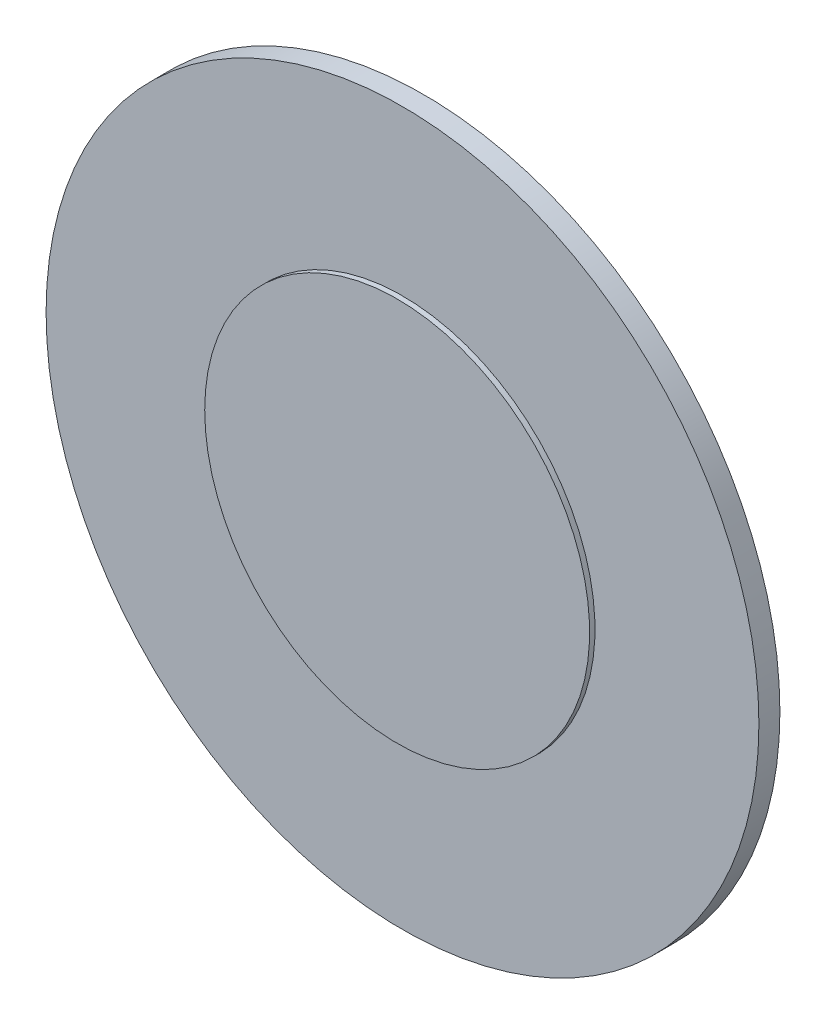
from build123d import *

# Parameters (mm, degrees)
SKETCH1_R   = 5.0927
OUTER_DEPTH = 0.3
SKETCH2_R   = 2.75
INNER_DEPTH = 0.0762


with BuildPart() as part:
    # Sketch1 → outer (new body)
    with BuildSketch(Plane.XY):
        Circle(SKETCH1_R)
    extrude(amount=OUTER_DEPTH)

    # Sketch2 → inner (add)
    with BuildSketch(Plane.XY.offset(0.3)):
        Circle(SKETCH2_R)
    extrude(amount=INNER_DEPTH)


solid = part.part
